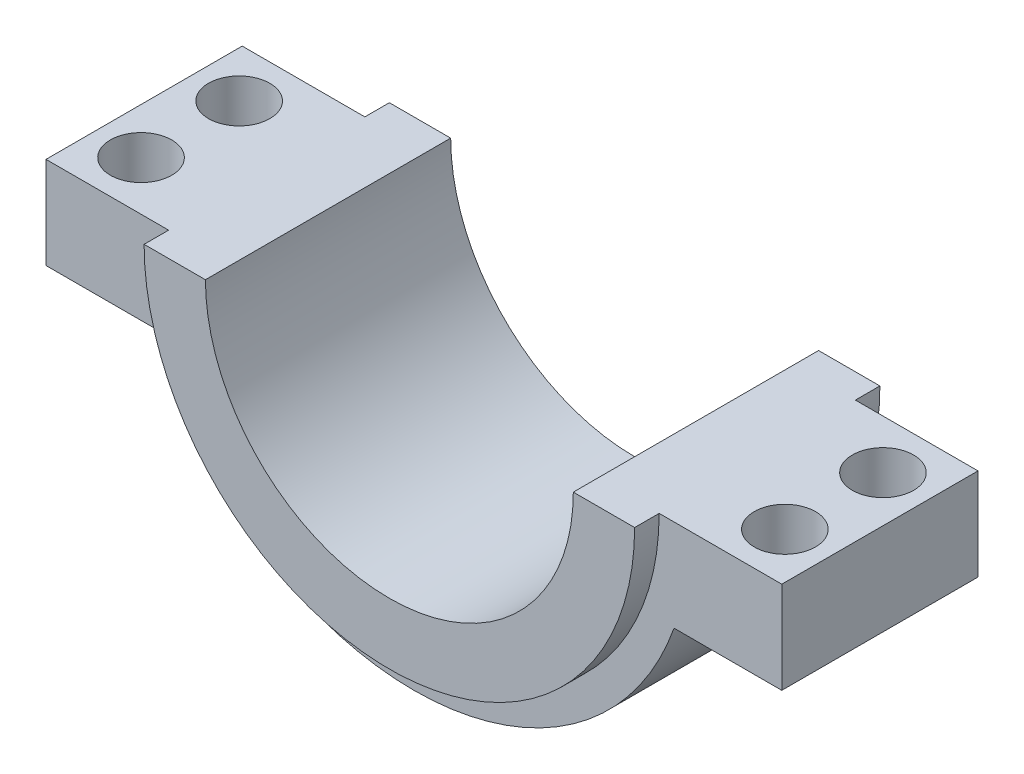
from build123d import *

# Parameters (mm, degrees)
DODANIE_WYCI_GNI_CIE1_DEPTH = 16
DODANIE_WYCI_GNI_CIE2_DEPTH = 20
SZKIC2_R                    = 5
WYTNIJ_WYCI_GNI_CIE1_DEPTH  = 78.620873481


with BuildPart() as part:
    # Szkic1 → Dodanie-wyci_gni_cie1 (new, symmetric)
    with BuildSketch(Plane.XY):
        with BuildLine():
            ThreePointArc((40, 0), (0, -40), (-40, 0))
            Line((-40, 0), (-60, 0))
            Line((-60, 0), (-60, -15))
            Line((-60, -15), (-42.426406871, -15))
            ThreePointArc((-42.426406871, -15), (0, -45), (42.426406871, -15))
            Line((42.426406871, -15), (60, -15))
            Line((60, -15), (60, 0))
            Line((60, 0), (40, 0))
        make_face()
    extrude(amount=DODANIE_WYCI_GNI_CIE1_DEPTH, both=True)

    # Szkic1_3 → Dodanie-wyci_gni_cie2 (add, symmetric)
    with BuildSketch(Plane.XY):
        with BuildLine():
            ThreePointArc((30, 0), (0, -30), (-30, 0))
            Line((-30, 0), (-40, 0))
            ThreePointArc((-40, 0), (0, -40), (40, 0))
            Line((40, 0), (30, 0))
        make_face()
    extrude(amount=DODANIE_WYCI_GNI_CIE2_DEPTH, both=True)

    # Szkic2 → Wytnij-wyci_gni_cie1 (cut, through all)
    with BuildSketch(Plane(origin=(0, 0, 0), x_dir=(1, 0, 0), z_dir=(0, 1, 0))):
        with Locations(Location((-52.5, 8, 0), (0, 0, 180))):
            Circle(SZKIC2_R)
        with Locations(Location((-52.5, -8, 0), (0, 0, 180))):
            Circle(SZKIC2_R)
    wytnij_wyci_gni_cie1 = extrude(amount=-WYTNIJ_WYCI_GNI_CIE1_DEPTH, mode=Mode.SUBTRACT)

    # Lustro1: Wytnij-wyci_gni_cie1 across plane
    add(wytnij_wyci_gni_cie1.mirror(Plane(origin=(0, 0, 0), x_dir=(0, 0, 1), z_dir=(1, 0, 0))), mode=Mode.SUBTRACT)


solid = part.part
